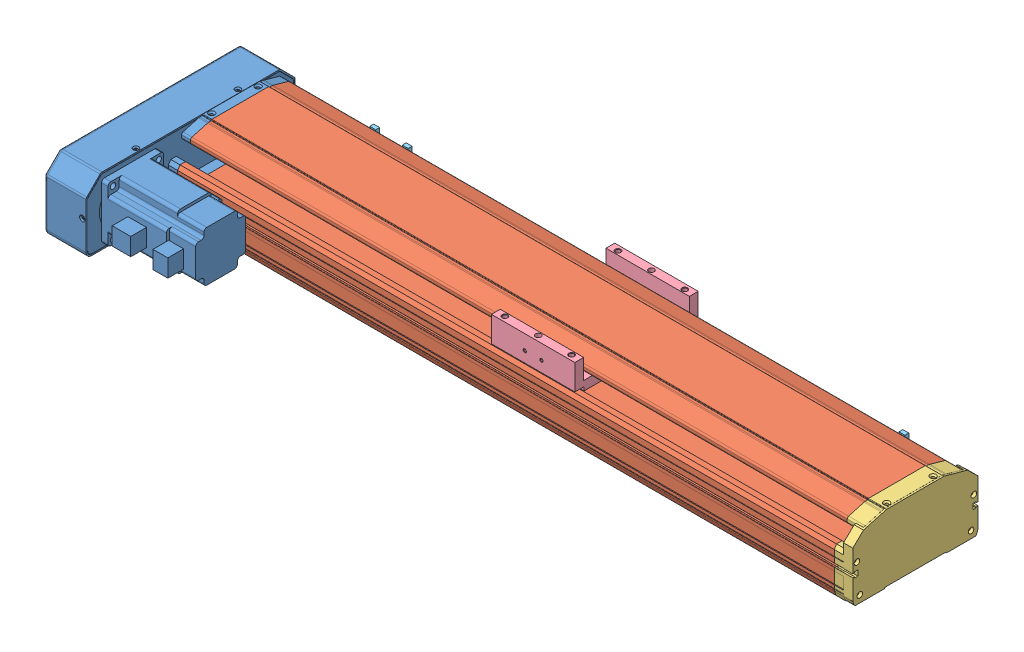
SolidWorks assembly TCD135-P-J3B-0.SLDASM, configuration 550 (file format 9000). Lengths in mm.
Overall size (783.73 78 237.4).
7 component instances, 5 part files, 19 mates.
Components (placement in the parent):
- TCD135-P-J3B-2-1: TCD135-P-J3B-2.sldprt [默认] at (322.5 0 0)
- TCD135-P-J3B-3-1: TCD135-P-J3B-3.SLDPRT [550] at (701.5 1.6 0) x (0 0 1) z (-1 0 0) size (135 73.5 708)
- TCD135-P-J3B-4-1: TCD135-P-J3B-4.SLDPRT [默认] at (572.5 0 0)
- TCD135-P-J3B-1-1: TCD135-P-J3B-1.sldprt [默认] at (375.8101 35.5 0) x (0 0 -1) z (1 0 0)
- TCD135-P-J3B-5-1: TCD135-P-J3B-5.sldprt [默认] at (-83.7996 -3.6004 -11) x (0 0 -1) z (1 0 0)
- TCD135-P-J3B-5-2: TCD135-P-J3B-5.sldprt [默认] at (486.8004 -3.6004 -11) x (0 0 -1) z (1 0 0)
- TCD135-P-J3B-5-3: TCD135-P-J3B-5.sldprt [默认] at (-48.7996 -3.6004 -11) x (0 0 -1) z (1 0 0)
Mates (geometry in assembly coordinates):
- 重合26: coincident anti-aligned: plane of TCD135-P-J3B-3-1 through (701.5 1.3082 -63.6472) normal (1 0 0); plane of TCD135-P-J3B-4-1 through (701.5 75.4539 101.0619) normal (-1 0 0)
- 重合27: coincident aligned: plane of TCD135-P-J3B-3-1 through (-6.5 11.6 67) normal (0 0 1); plane of TCD135-P-J3B-4-1 through (572.5 17.6 67) normal (0 0 1)
- 重合28: coincident aligned: plane of TCD135-P-J3B-3-1 through (-6.5 73.5 30.5) normal (0 1 0); plane of TCD135-P-J3B-4-1 through (576.6 73.5 0) normal (0 1 0)
- 距离1: distance = 78 mm anti-aligned: plane of TCD135-P-J3B-1-1 through (375.8101 78 61.75) normal (0 1 0); plane of TCD135-P-J3B-3-1 through (-6.5 0 34.1) normal (0 -1 0)
- 距离2: distance = 0.5 mm aligned: plane of TCD135-P-J3B-1-1 through (375.8101 64.25 -66.5) normal (0 0 -1); plane of TCD135-P-J3B-3-1 through (-6.5 23.6 -67) normal (0 0 -1)
- LimitDistance1: limit distance = 392.3101 mm aligned: plane of TCD135-P-J3B-1-1 through (330.8101 62.25 0) normal (-1 0 0); plane of TCD135-P-J3B-2-1 through (-61.5 37.25 43.5) normal (-1 0 0)
- LimitDistance2: limit distance = 300.6899 mm aligned: plane of TCD135-P-J3B-4-1 through (721.5 37 0) normal (1 0 0); plane of TCD135-P-J3B-1-1 through (420.8101 62.25 0) normal (1 0 0)
- 重合35: coincident aligned: plane of TCD135-P-J3B-3-1 through (-6.5 73.5 30.5) normal (0 1 0); plane of TCD135-P-J3B-2-1 through (326.6 73.5 0) normal (0 1 0)
- 重合36: coincident aligned: plane of TCD135-P-J3B-3-1 through (-6.5 11.6 67) normal (0 0 1); plane of TCD135-P-J3B-2-1 through (322.5 17.6 67) normal (0 0 1)
- 重合37: coincident anti-aligned: plane of TCD135-P-J3B-3-1 through (-6.5 1.3082 -63.6472) normal (-1 0 0); plane of TCD135-P-J3B-2-1 through (-6.5 -716.037 -136.3376) normal (1 0 0)
- 重合38: coincident anti-aligned: plane of TCD135-P-J3B-3-1 through (-6.5 27.5 -67.5) normal (0 0 -1); plane of TCD135-P-J3B-5-1 through (72.7 18.6 -67.5) normal (0 0 1)
- 重合39: coincident aligned: plane of TCD135-P-J3B-3-1 through (-6.5 27.8 -65.8) normal (0 1 0); plane of TCD135-P-J3B-5-1 through (49.1 27.8 -67.5) normal (0 1 0)
- 重合40: coincident anti-aligned: plane of TCD135-P-J3B-3-1 through (-6.5 27.5 -67.5) normal (0 0 -1); plane of TCD135-P-J3B-5-2 through (643.3 18.6 -67.5) normal (0 0 1)
- 重合41: coincident aligned: plane of TCD135-P-J3B-3-1 through (-6.5 27.8 -65.8) normal (0 1 0); plane of TCD135-P-J3B-5-2 through (619.7 27.8 -67.5) normal (0 1 0)
- 重合42: coincident anti-aligned: plane of TCD135-P-J3B-3-1 through (-6.5 27.5 -67.5) normal (0 0 -1); plane of TCD135-P-J3B-5-3 through (107.7 18.6 -67.5) normal (0 0 1)
- 重合43: coincident aligned: plane of TCD135-P-J3B-3-1 through (-6.5 27.8 -65.8) normal (0 1 0); plane of TCD135-P-J3B-5-3 through (84.1 27.8 -67.5) normal (0 1 0)
- 距离3: distance = 35 mm aligned: plane of TCD135-P-J3B-5-3 through (91.5 18.6 -67.5) normal (-1 0 0); plane of TCD135-P-J3B-5-1 through (56.5 18.6 -67.5) normal (-1 0 0)
- 距离4: distance = 118 mm aligned: plane of TCD135-P-J3B-5-1 through (56.5 18.6 -67.5) normal (-1 0 0); plane of TCD135-P-J3B-2-1 through (-61.5 37.25 43.5) normal (-1 0 0)
- 距离5: distance = 88 mm aligned: plane of TCD135-P-J3B-5-2 through (633.5 18.6 -67.5) normal (1 0 0); plane of TCD135-P-J3B-4-1 through (721.5 37 0) normal (1 0 0)
